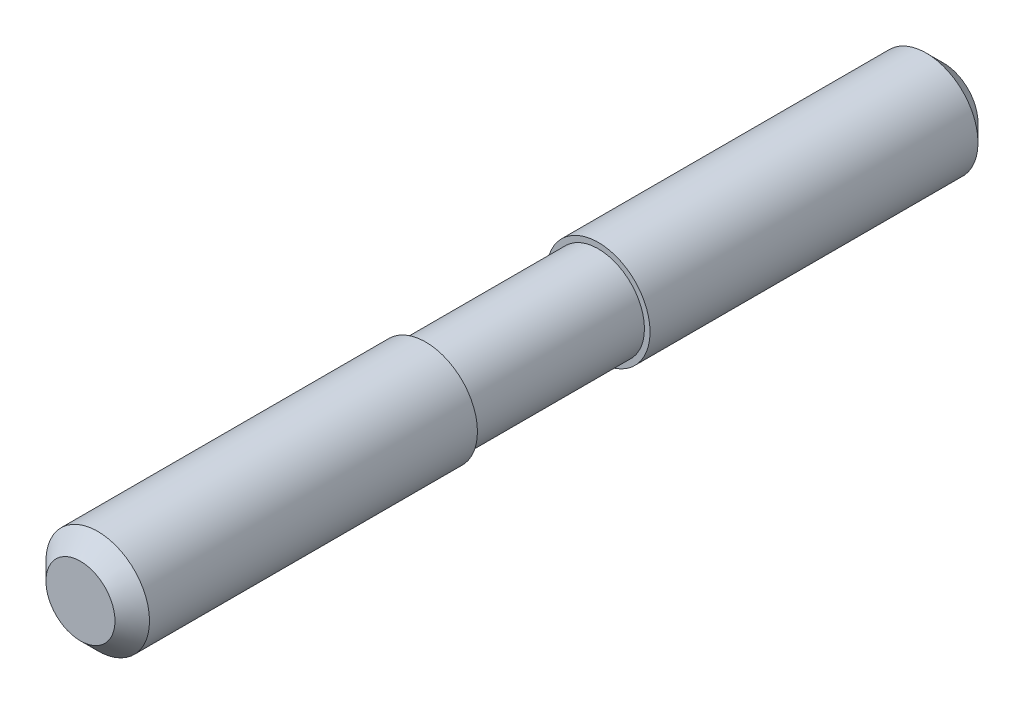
ISO-10303-21;
HEADER;
FILE_DESCRIPTION(('STEP AP214'),'2;1');
FILE_NAME('part.step','',(''),(''),'','','');
FILE_SCHEMA(('AUTOMOTIVE_DESIGN { 1 0 10303 214 1 1 1 1 }'));
ENDSEC;
DATA;
#1=APPLICATION_CONTEXT('core data for automotive mechanical design processes');
#2=APPLICATION_PROTOCOL_DEFINITION('international standard','automotive_design',2000,#1);
#3=PRODUCT_CONTEXT('',#1,'mechanical');
#4=PRODUCT('Part','Part','',(#3));
#5=PRODUCT_RELATED_PRODUCT_CATEGORY('part','',(#4));
#6=PRODUCT_DEFINITION_FORMATION('','',#4);
#7=PRODUCT_DEFINITION_CONTEXT('part definition',#1,'design');
#8=PRODUCT_DEFINITION('design','',#6,#7);
#9=PRODUCT_DEFINITION_SHAPE('','',#8);
#10=(LENGTH_UNIT() NAMED_UNIT(*) SI_UNIT(.MILLI.,.METRE.));
#11=(NAMED_UNIT(*) PLANE_ANGLE_UNIT() SI_UNIT($,.RADIAN.));
#12=(NAMED_UNIT(*) SI_UNIT($,.STERADIAN.) SOLID_ANGLE_UNIT());
#13=UNCERTAINTY_MEASURE_WITH_UNIT(LENGTH_MEASURE(1.E-05),#10,'distance_accuracy_value','');
#14=(GEOMETRIC_REPRESENTATION_CONTEXT(3) GLOBAL_UNCERTAINTY_ASSIGNED_CONTEXT((#13)) GLOBAL_UNIT_ASSIGNED_CONTEXT((#10,
#11,#12)) REPRESENTATION_CONTEXT('',''));
#15=CARTESIAN_POINT('',(0.,0.,0.));
#16=DIRECTION('',(0.,0.,1.));
#17=DIRECTION('',(1.,0.,0.));
#18=AXIS2_PLACEMENT_3D('',#15,#16,#17);
#19=CARTESIAN_POINT('',(0.,0.,0.));
#20=DIRECTION('',(0.,0.,1.));
#21=DIRECTION('',(1.,0.,0.));
#22=AXIS2_PLACEMENT_3D('',#19,#20,#21);
#23=PLANE('',#22);
#24=CARTESIAN_POINT('',(0.,0.,0.));
#25=DIRECTION('',(0.,0.,1.));
#26=DIRECTION('',(1.,0.,0.));
#27=AXIS2_PLACEMENT_3D('',#24,#25,#26);
#28=CIRCLE('',#27,4.);
#29=CARTESIAN_POINT('',(4.,0.,0.));
#30=VERTEX_POINT('',#29);
#31=EDGE_CURVE('E8',#30,#30,#28,.T.);
#32=ORIENTED_EDGE('',*,*,#31,.F.);
#33=EDGE_LOOP('',(#32));
#34=FACE_BOUND('',#33,.T.);
#35=ADVANCED_FACE('F12',(#34),#23,.F.);
#36=CARTESIAN_POINT('',(0.,0.,2.));
#37=DIRECTION('',(0.,0.,1.));
#38=DIRECTION('',(1.,0.,0.));
#39=AXIS2_PLACEMENT_3D('',#36,#37,#38);
#40=CONICAL_SURFACE('',#39,6.,0.785398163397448);
#41=ORIENTED_EDGE('',*,*,#31,.T.);
#42=EDGE_LOOP('',(#41));
#43=FACE_BOUND('',#42,.T.);
#44=CARTESIAN_POINT('',(0.,0.,2.));
#45=DIRECTION('',(0.,0.,1.));
#46=DIRECTION('',(1.,0.,0.));
#47=AXIS2_PLACEMENT_3D('',#44,#45,#46);
#48=CIRCLE('',#47,6.);
#49=CARTESIAN_POINT('',(6.,0.,2.));
#50=VERTEX_POINT('',#49);
#51=EDGE_CURVE('E18',#50,#50,#48,.T.);
#52=ORIENTED_EDGE('',*,*,#51,.F.);
#53=EDGE_LOOP('',(#52));
#54=FACE_BOUND('',#53,.T.);
#55=ADVANCED_FACE('F62',(#43,#54),#40,.T.);
#56=CARTESIAN_POINT('',(0.,0.,70.));
#57=DIRECTION('',(0.,0.,1.));
#58=DIRECTION('',(1.,0.,0.));
#59=AXIS2_PLACEMENT_3D('',#56,#57,#58);
#60=CYLINDRICAL_SURFACE('',#59,6.);
#61=CARTESIAN_POINT('',(0.,0.,40.));
#62=DIRECTION('',(0.,0.,1.));
#63=DIRECTION('',(1.,0.,0.));
#64=AXIS2_PLACEMENT_3D('',#61,#62,#63);
#65=CIRCLE('',#64,6.);
#66=CARTESIAN_POINT('',(6.,0.,40.));
#67=VERTEX_POINT('',#66);
#68=EDGE_CURVE('E22',#67,#67,#65,.T.);
#69=ORIENTED_EDGE('',*,*,#68,.F.);
#70=EDGE_LOOP('',(#69));
#71=FACE_BOUND('',#70,.T.);
#72=ORIENTED_EDGE('',*,*,#51,.T.);
#73=EDGE_LOOP('',(#72));
#74=FACE_BOUND('',#73,.T.);
#75=ADVANCED_FACE('F68',(#71,#74),#60,.T.);
#76=CARTESIAN_POINT('',(6.,0.,40.));
#77=DIRECTION('',(0.,0.,-1.));
#78=DIRECTION('',(-1.,0.,0.));
#79=AXIS2_PLACEMENT_3D('',#76,#77,#78);
#80=PLANE('',#79);
#81=CARTESIAN_POINT('',(0.,0.,40.));
#82=DIRECTION('',(0.,0.,1.));
#83=DIRECTION('',(1.,0.,0.));
#84=AXIS2_PLACEMENT_3D('',#81,#82,#83);
#85=CIRCLE('',#84,5.35);
#86=CARTESIAN_POINT('',(5.35,0.,40.));
#87=VERTEX_POINT('',#86);
#88=EDGE_CURVE('E26',#87,#87,#85,.T.);
#89=ORIENTED_EDGE('',*,*,#88,.F.);
#90=EDGE_LOOP('',(#89));
#91=FACE_BOUND('',#90,.T.);
#92=ORIENTED_EDGE('',*,*,#68,.T.);
#93=EDGE_LOOP('',(#92));
#94=FACE_BOUND('',#93,.T.);
#95=ADVANCED_FACE('F73',(#91,#94),#80,.F.);
#96=CARTESIAN_POINT('',(0.,0.,70.));
#97=DIRECTION('',(0.,0.,1.));
#98=DIRECTION('',(1.,0.,0.));
#99=AXIS2_PLACEMENT_3D('',#96,#97,#98);
#100=CYLINDRICAL_SURFACE('',#99,5.35);
#101=CARTESIAN_POINT('',(0.,0.,60.));
#102=DIRECTION('',(0.,0.,1.));
#103=DIRECTION('',(1.,0.,0.));
#104=AXIS2_PLACEMENT_3D('',#101,#102,#103);
#105=CIRCLE('',#104,5.35);
#106=CARTESIAN_POINT('',(5.35,0.,60.));
#107=VERTEX_POINT('',#106);
#108=EDGE_CURVE('E31',#107,#107,#105,.T.);
#109=ORIENTED_EDGE('',*,*,#108,.F.);
#110=EDGE_LOOP('',(#109));
#111=FACE_BOUND('',#110,.T.);
#112=ORIENTED_EDGE('',*,*,#88,.T.);
#113=EDGE_LOOP('',(#112));
#114=FACE_BOUND('',#113,.T.);
#115=ADVANCED_FACE('F80',(#111,#114),#100,.T.);
#116=CARTESIAN_POINT('',(5.35,0.,60.));
#117=DIRECTION('',(0.,0.,1.));
#118=DIRECTION('',(1.,0.,0.));
#119=AXIS2_PLACEMENT_3D('',#116,#117,#118);
#120=PLANE('',#119);
#121=CARTESIAN_POINT('',(0.,0.,60.));
#122=DIRECTION('',(0.,0.,1.));
#123=DIRECTION('',(1.,0.,0.));
#124=AXIS2_PLACEMENT_3D('',#121,#122,#123);
#125=CIRCLE('',#124,6.);
#126=CARTESIAN_POINT('',(6.,0.,60.));
#127=VERTEX_POINT('',#126);
#128=EDGE_CURVE('E34',#127,#127,#125,.T.);
#129=ORIENTED_EDGE('',*,*,#128,.F.);
#130=EDGE_LOOP('',(#129));
#131=FACE_BOUND('',#130,.T.);
#132=ORIENTED_EDGE('',*,*,#108,.T.);
#133=EDGE_LOOP('',(#132));
#134=FACE_BOUND('',#133,.T.);
#135=ADVANCED_FACE('F58',(#131,#134),#120,.F.);
#136=CARTESIAN_POINT('',(0.,0.,70.));
#137=DIRECTION('',(0.,0.,1.));
#138=DIRECTION('',(1.,0.,0.));
#139=AXIS2_PLACEMENT_3D('',#136,#137,#138);
#140=CYLINDRICAL_SURFACE('',#139,6.);
#141=CARTESIAN_POINT('',(0.,0.,98.));
#142=DIRECTION('',(0.,0.,1.));
#143=DIRECTION('',(1.,0.,0.));
#144=AXIS2_PLACEMENT_3D('',#141,#142,#143);
#145=CIRCLE('',#144,6.);
#146=CARTESIAN_POINT('',(6.,0.,98.));
#147=VERTEX_POINT('',#146);
#148=EDGE_CURVE('E37',#147,#147,#145,.T.);
#149=ORIENTED_EDGE('',*,*,#148,.F.);
#150=EDGE_LOOP('',(#149));
#151=FACE_BOUND('',#150,.T.);
#152=ORIENTED_EDGE('',*,*,#128,.T.);
#153=EDGE_LOOP('',(#152));
#154=FACE_BOUND('',#153,.T.);
#155=ADVANCED_FACE('F48',(#151,#154),#140,.T.);
#156=CARTESIAN_POINT('',(0.,0.,100.));
#157=DIRECTION('',(0.,0.,-1.));
#158=DIRECTION('',(-1.,0.,0.));
#159=AXIS2_PLACEMENT_3D('',#156,#157,#158);
#160=CONICAL_SURFACE('',#159,4.,0.785398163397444);
#161=ORIENTED_EDGE('',*,*,#148,.T.);
#162=EDGE_LOOP('',(#161));
#163=FACE_BOUND('',#162,.T.);
#164=CARTESIAN_POINT('',(0.,0.,100.));
#165=DIRECTION('',(0.,0.,1.));
#166=DIRECTION('',(1.,0.,0.));
#167=AXIS2_PLACEMENT_3D('',#164,#165,#166);
#168=CIRCLE('',#167,4.);
#169=CARTESIAN_POINT('',(4.,0.,100.));
#170=VERTEX_POINT('',#169);
#171=EDGE_CURVE('E40',#170,#170,#168,.T.);
#172=ORIENTED_EDGE('',*,*,#171,.F.);
#173=EDGE_LOOP('',(#172));
#174=FACE_BOUND('',#173,.T.);
#175=ADVANCED_FACE('F46',(#163,#174),#160,.T.);
#176=CARTESIAN_POINT('',(4.,0.,100.));
#177=DIRECTION('',(0.,0.,-1.));
#178=DIRECTION('',(-1.,0.,0.));
#179=AXIS2_PLACEMENT_3D('',#176,#177,#178);
#180=PLANE('',#179);
#181=ORIENTED_EDGE('',*,*,#171,.T.);
#182=EDGE_LOOP('',(#181));
#183=FACE_BOUND('',#182,.T.);
#184=ADVANCED_FACE('F44',(#183),#180,.F.);
#185=CLOSED_SHELL('',(#35,#55,#75,#95,#115,#135,#155,#175,#184));
#186=MANIFOLD_SOLID_BREP('B1',#185);
#187=ADVANCED_BREP_SHAPE_REPRESENTATION('',(#18,#186),#14);
#188=SHAPE_DEFINITION_REPRESENTATION(#9,#187);
ENDSEC;
END-ISO-10303-21;
